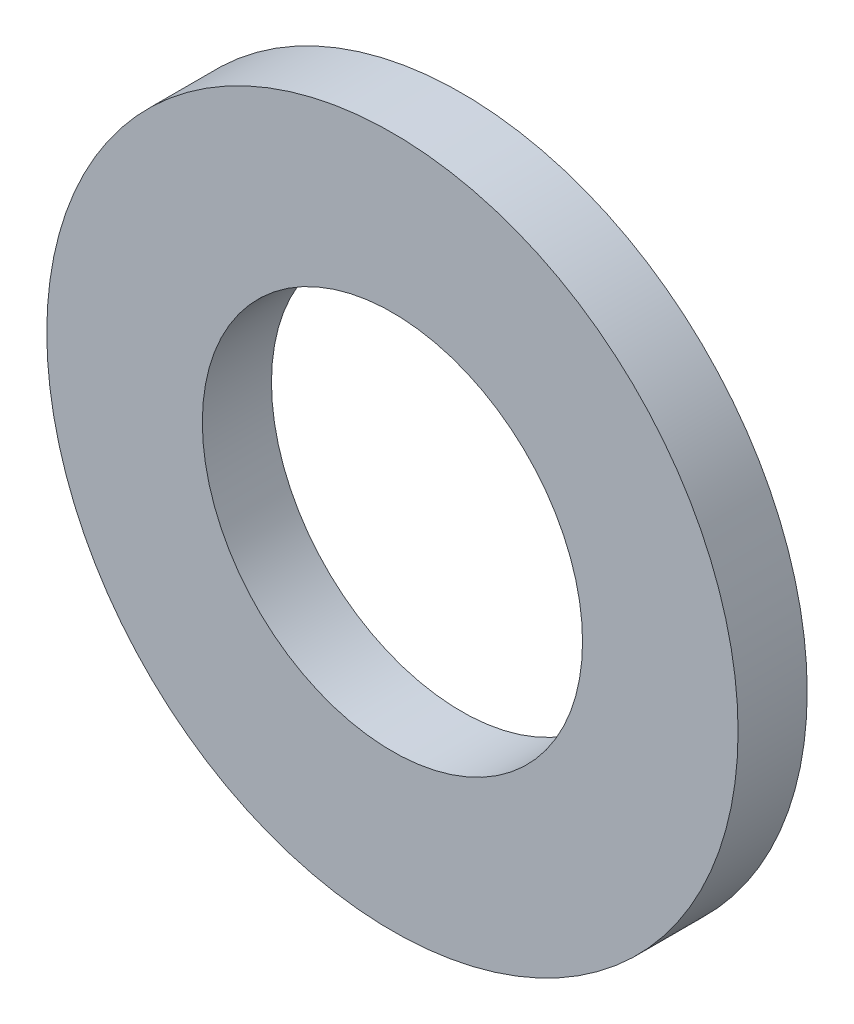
ISO-10303-21;
HEADER;
FILE_DESCRIPTION(('STEP AP214'),'2;1');
FILE_NAME('part.step','',(''),(''),'','','');
FILE_SCHEMA(('AUTOMOTIVE_DESIGN { 1 0 10303 214 1 1 1 1 }'));
ENDSEC;
DATA;
#1=APPLICATION_CONTEXT('core data for automotive mechanical design processes');
#2=APPLICATION_PROTOCOL_DEFINITION('international standard','automotive_design',2000,#1);
#3=PRODUCT_CONTEXT('',#1,'mechanical');
#4=PRODUCT('Part','Part','',(#3));
#5=PRODUCT_RELATED_PRODUCT_CATEGORY('part','',(#4));
#6=PRODUCT_DEFINITION_FORMATION('','',#4);
#7=PRODUCT_DEFINITION_CONTEXT('part definition',#1,'design');
#8=PRODUCT_DEFINITION('design','',#6,#7);
#9=PRODUCT_DEFINITION_SHAPE('','',#8);
#10=(LENGTH_UNIT() NAMED_UNIT(*) SI_UNIT(.MILLI.,.METRE.));
#11=(NAMED_UNIT(*) PLANE_ANGLE_UNIT() SI_UNIT($,.RADIAN.));
#12=(NAMED_UNIT(*) SI_UNIT($,.STERADIAN.) SOLID_ANGLE_UNIT());
#13=UNCERTAINTY_MEASURE_WITH_UNIT(LENGTH_MEASURE(1.E-05),#10,'distance_accuracy_value','');
#14=(GEOMETRIC_REPRESENTATION_CONTEXT(3) GLOBAL_UNCERTAINTY_ASSIGNED_CONTEXT((#13)) GLOBAL_UNIT_ASSIGNED_CONTEXT((#10,
#11,#12)) REPRESENTATION_CONTEXT('',''));
#15=CARTESIAN_POINT('',(0.,0.,0.));
#16=DIRECTION('',(0.,0.,1.));
#17=DIRECTION('',(1.,0.,0.));
#18=AXIS2_PLACEMENT_3D('',#15,#16,#17);
#19=CARTESIAN_POINT('',(0.,0.,-5.5));
#20=DIRECTION('',(0.,0.,-1.));
#21=DIRECTION('',(-1.,0.,0.));
#22=AXIS2_PLACEMENT_3D('',#19,#20,#21);
#23=CYLINDRICAL_SURFACE('',#22,5.5);
#24=CARTESIAN_POINT('',(0.,0.,0.));
#25=DIRECTION('',(0.,0.,-1.));
#26=DIRECTION('',(-1.,0.,0.));
#27=AXIS2_PLACEMENT_3D('',#24,#25,#26);
#28=CIRCLE('',#27,5.5);
#29=CARTESIAN_POINT('',(-5.5,0.,0.));
#30=VERTEX_POINT('',#29);
#31=EDGE_CURVE('E10',#30,#30,#28,.T.);
#32=ORIENTED_EDGE('',*,*,#31,.F.);
#33=EDGE_LOOP('',(#32));
#34=FACE_BOUND('',#33,.T.);
#35=CARTESIAN_POINT('',(0.,0.,-2.));
#36=DIRECTION('',(0.,0.,-1.));
#37=DIRECTION('',(-1.,0.,0.));
#38=AXIS2_PLACEMENT_3D('',#35,#36,#37);
#39=CIRCLE('',#38,5.5);
#40=CARTESIAN_POINT('',(-5.5,0.,-2.));
#41=VERTEX_POINT('',#40);
#42=EDGE_CURVE('E47',#41,#41,#39,.T.);
#43=ORIENTED_EDGE('',*,*,#42,.T.);
#44=EDGE_LOOP('',(#43));
#45=FACE_BOUND('',#44,.T.);
#46=ADVANCED_FACE('F33',(#34,#45),#23,.F.);
#47=CARTESIAN_POINT('',(5.5,0.,0.));
#48=DIRECTION('',(0.,0.,-1.));
#49=DIRECTION('',(-1.,0.,0.));
#50=AXIS2_PLACEMENT_3D('',#47,#48,#49);
#51=PLANE('',#50);
#52=CARTESIAN_POINT('',(0.,0.,0.));
#53=DIRECTION('',(0.,0.,-1.));
#54=DIRECTION('',(-1.,0.,0.));
#55=AXIS2_PLACEMENT_3D('',#52,#53,#54);
#56=CIRCLE('',#55,10.);
#57=CARTESIAN_POINT('',(-10.,0.,0.));
#58=VERTEX_POINT('',#57);
#59=EDGE_CURVE('E39',#58,#58,#56,.T.);
#60=ORIENTED_EDGE('',*,*,#59,.F.);
#61=EDGE_LOOP('',(#60));
#62=FACE_BOUND('',#61,.T.);
#63=ORIENTED_EDGE('',*,*,#31,.T.);
#64=EDGE_LOOP('',(#63));
#65=FACE_BOUND('',#64,.T.);
#66=ADVANCED_FACE('F62',(#62,#65),#51,.F.);
#67=CARTESIAN_POINT('',(0.,0.,-5.5));
#68=DIRECTION('',(0.,0.,-1.));
#69=DIRECTION('',(-1.,0.,0.));
#70=AXIS2_PLACEMENT_3D('',#67,#68,#69);
#71=CYLINDRICAL_SURFACE('',#70,10.);
#72=CARTESIAN_POINT('',(0.,0.,-2.));
#73=DIRECTION('',(0.,0.,-1.));
#74=DIRECTION('',(-1.,0.,0.));
#75=AXIS2_PLACEMENT_3D('',#72,#73,#74);
#76=CIRCLE('',#75,10.);
#77=CARTESIAN_POINT('',(-10.,0.,-2.));
#78=VERTEX_POINT('',#77);
#79=EDGE_CURVE('E43',#78,#78,#76,.T.);
#80=ORIENTED_EDGE('',*,*,#79,.F.);
#81=EDGE_LOOP('',(#80));
#82=FACE_BOUND('',#81,.T.);
#83=ORIENTED_EDGE('',*,*,#59,.T.);
#84=EDGE_LOOP('',(#83));
#85=FACE_BOUND('',#84,.T.);
#86=ADVANCED_FACE('F57',(#82,#85),#71,.T.);
#87=CARTESIAN_POINT('',(10.,0.,-2.));
#88=DIRECTION('',(0.,0.,1.));
#89=DIRECTION('',(1.,0.,0.));
#90=AXIS2_PLACEMENT_3D('',#87,#88,#89);
#91=PLANE('',#90);
#92=ORIENTED_EDGE('',*,*,#42,.F.);
#93=EDGE_LOOP('',(#92));
#94=FACE_BOUND('',#93,.T.);
#95=ORIENTED_EDGE('',*,*,#79,.T.);
#96=EDGE_LOOP('',(#95));
#97=FACE_BOUND('',#96,.T.);
#98=ADVANCED_FACE('F54',(#94,#97),#91,.F.);
#99=CLOSED_SHELL('',(#46,#66,#86,#98));
#100=MANIFOLD_SOLID_BREP('B2',#99);
#101=ADVANCED_BREP_SHAPE_REPRESENTATION('',(#18,#100),#14);
#102=SHAPE_DEFINITION_REPRESENTATION(#9,#101);
ENDSEC;
END-ISO-10303-21;
